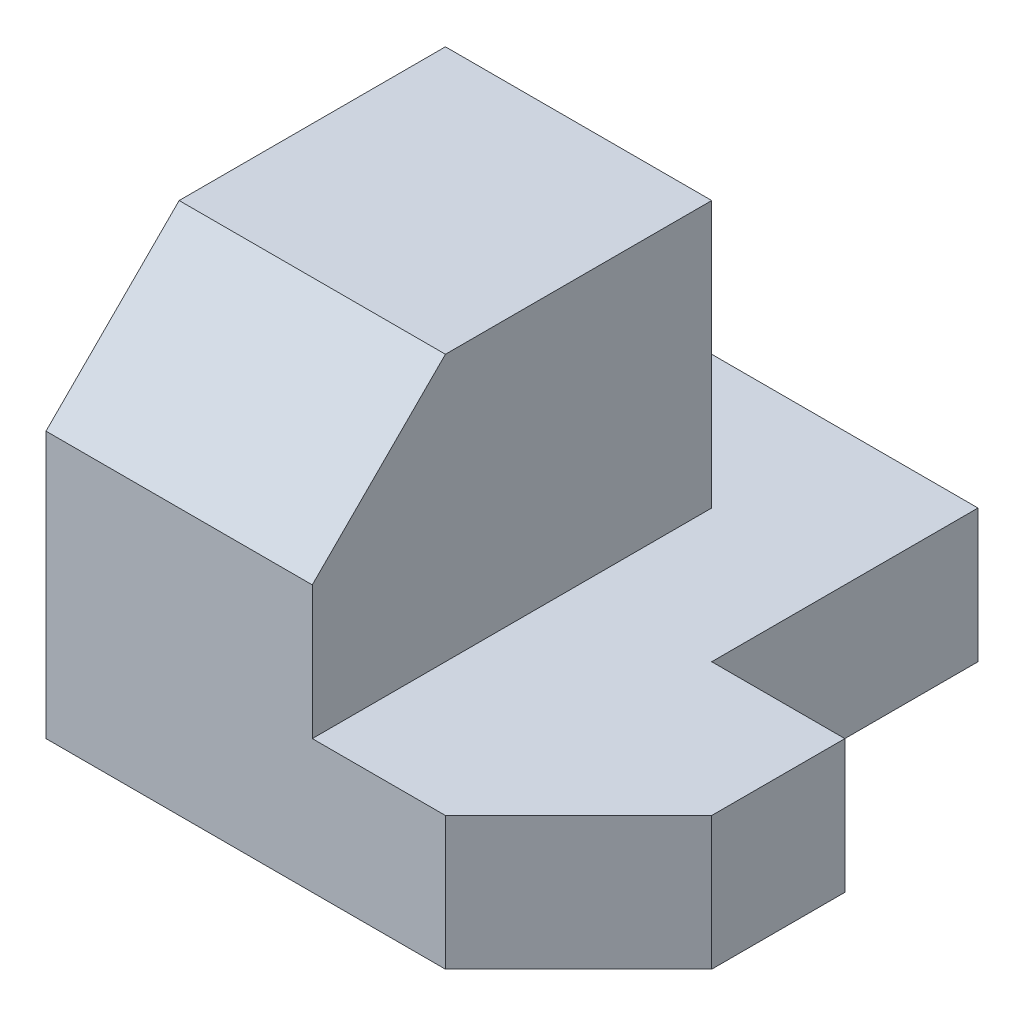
ISO-10303-21;
HEADER;
FILE_DESCRIPTION(('STEP AP214'),'2;1');
FILE_NAME('part.step','',(''),(''),'','','');
FILE_SCHEMA(('AUTOMOTIVE_DESIGN { 1 0 10303 214 1 1 1 1 }'));
ENDSEC;
DATA;
#1=APPLICATION_CONTEXT('core data for automotive mechanical design processes');
#2=APPLICATION_PROTOCOL_DEFINITION('international standard','automotive_design',2000,#1);
#3=PRODUCT_CONTEXT('',#1,'mechanical');
#4=PRODUCT('Part','Part','',(#3));
#5=PRODUCT_RELATED_PRODUCT_CATEGORY('part','',(#4));
#6=PRODUCT_DEFINITION_FORMATION('','',#4);
#7=PRODUCT_DEFINITION_CONTEXT('part definition',#1,'design');
#8=PRODUCT_DEFINITION('design','',#6,#7);
#9=PRODUCT_DEFINITION_SHAPE('','',#8);
#10=(LENGTH_UNIT() NAMED_UNIT(*) SI_UNIT(.MILLI.,.METRE.));
#11=(NAMED_UNIT(*) PLANE_ANGLE_UNIT() SI_UNIT($,.RADIAN.));
#12=(NAMED_UNIT(*) SI_UNIT($,.STERADIAN.) SOLID_ANGLE_UNIT());
#13=UNCERTAINTY_MEASURE_WITH_UNIT(LENGTH_MEASURE(1.E-05),#10,'distance_accuracy_value','');
#14=(GEOMETRIC_REPRESENTATION_CONTEXT(3) GLOBAL_UNCERTAINTY_ASSIGNED_CONTEXT((#13)) GLOBAL_UNIT_ASSIGNED_CONTEXT((#10,
#11,#12)) REPRESENTATION_CONTEXT('',''));
#15=CARTESIAN_POINT('',(0.,0.,0.));
#16=DIRECTION('',(0.,0.,1.));
#17=DIRECTION('',(1.,0.,0.));
#18=AXIS2_PLACEMENT_3D('',#15,#16,#17);
#19=CARTESIAN_POINT('',(30.,10.,0.));
#20=DIRECTION('',(0.,0.,1.));
#21=DIRECTION('',(1.,0.,0.));
#22=AXIS2_PLACEMENT_3D('',#19,#20,#21);
#23=PLANE('',#22);
#24=DIRECTION('',(-1.,0.,0.));
#25=VECTOR('',#24,1.);
#26=CARTESIAN_POINT('',(30.,0.,0.));
#27=LINE('',#26,#25);
#28=CARTESIAN_POINT('',(30.,0.,0.));
#29=VERTEX_POINT('',#28);
#30=CARTESIAN_POINT('',(0.,0.,0.));
#31=VERTEX_POINT('',#30);
#32=EDGE_CURVE('E152',#29,#31,#27,.T.);
#33=ORIENTED_EDGE('',*,*,#32,.T.);
#34=DIRECTION('',(0.,-1.,0.));
#35=VECTOR('',#34,1.);
#36=CARTESIAN_POINT('',(0.,10.,0.));
#37=LINE('',#36,#35);
#38=CARTESIAN_POINT('',(0.,10.,0.));
#39=VERTEX_POINT('',#38);
#40=EDGE_CURVE('E150',#39,#31,#37,.T.);
#41=ORIENTED_EDGE('',*,*,#40,.F.);
#42=DIRECTION('',(-1.,0.,0.));
#43=VECTOR('',#42,1.);
#44=CARTESIAN_POINT('',(30.,10.,0.));
#45=LINE('',#44,#43);
#46=CARTESIAN_POINT('',(30.,10.,0.));
#47=VERTEX_POINT('',#46);
#48=EDGE_CURVE('E176',#47,#39,#45,.T.);
#49=ORIENTED_EDGE('',*,*,#48,.F.);
#50=DIRECTION('',(0.,-1.,0.));
#51=VECTOR('',#50,1.);
#52=CARTESIAN_POINT('',(30.,10.,0.));
#53=LINE('',#52,#51);
#54=EDGE_CURVE('E177',#47,#29,#53,.T.);
#55=ORIENTED_EDGE('',*,*,#54,.T.);
#56=EDGE_LOOP('',(#33,#41,#49,#55));
#57=FACE_BOUND('',#56,.T.);
#58=ADVANCED_FACE('F30',(#57),#23,.F.);
#59=CARTESIAN_POINT('',(0.,10.,0.));
#60=DIRECTION('',(1.,0.,0.));
#61=DIRECTION('',(0.,0.,-1.));
#62=AXIS2_PLACEMENT_3D('',#59,#60,#61);
#63=PLANE('',#62);
#64=DIRECTION('',(0.,-1.,0.));
#65=VECTOR('',#64,1.);
#66=CARTESIAN_POINT('',(0.,10.,40.));
#67=LINE('',#66,#65);
#68=CARTESIAN_POINT('',(0.,20.,40.));
#69=VERTEX_POINT('',#68);
#70=CARTESIAN_POINT('',(0.,0.,40.));
#71=VERTEX_POINT('',#70);
#72=EDGE_CURVE('E191',#69,#71,#67,.T.);
#73=ORIENTED_EDGE('',*,*,#72,.F.);
#74=DIRECTION('',(0.,-0.707106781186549,0.707106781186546));
#75=VECTOR('',#74,1.);
#76=CARTESIAN_POINT('',(0.,30.,30.));
#77=LINE('',#76,#75);
#78=CARTESIAN_POINT('',(0.,30.,30.));
#79=VERTEX_POINT('',#78);
#80=EDGE_CURVE('E11',#69,#79,#77,.F.);
#81=ORIENTED_EDGE('',*,*,#80,.T.);
#82=DIRECTION('',(0.,0.,1.));
#83=VECTOR('',#82,1.);
#84=CARTESIAN_POINT('',(0.,30.,40.));
#85=LINE('',#84,#83);
#86=CARTESIAN_POINT('',(0.,30.,10.));
#87=VERTEX_POINT('',#86);
#88=EDGE_CURVE('E119',#87,#79,#85,.T.);
#89=ORIENTED_EDGE('',*,*,#88,.F.);
#90=DIRECTION('',(0.,-1.,0.));
#91=VECTOR('',#90,1.);
#92=CARTESIAN_POINT('',(0.,30.,10.));
#93=LINE('',#92,#91);
#94=CARTESIAN_POINT('',(0.,10.,10.));
#95=VERTEX_POINT('',#94);
#96=EDGE_CURVE('E130',#87,#95,#93,.T.);
#97=ORIENTED_EDGE('',*,*,#96,.T.);
#98=DIRECTION('',(0.,0.,1.));
#99=VECTOR('',#98,1.);
#100=CARTESIAN_POINT('',(0.,10.,0.));
#101=LINE('',#100,#99);
#102=EDGE_CURVE('E195',#39,#95,#101,.T.);
#103=ORIENTED_EDGE('',*,*,#102,.F.);
#104=ORIENTED_EDGE('',*,*,#40,.T.);
#105=DIRECTION('',(0.,0.,1.));
#106=VECTOR('',#105,1.);
#107=CARTESIAN_POINT('',(0.,0.,0.));
#108=LINE('',#107,#106);
#109=EDGE_CURVE('E154',#31,#71,#108,.T.);
#110=ORIENTED_EDGE('',*,*,#109,.T.);
#111=EDGE_LOOP('',(#73,#81,#89,#97,#103,#104,#110));
#112=FACE_BOUND('',#111,.T.);
#113=ADVANCED_FACE('F220',(#112),#63,.F.);
#114=CARTESIAN_POINT('',(0.,10.,40.));
#115=DIRECTION('',(0.,0.,-1.));
#116=DIRECTION('',(-1.,0.,0.));
#117=AXIS2_PLACEMENT_3D('',#114,#115,#116);
#118=PLANE('',#117);
#119=DIRECTION('',(0.,-1.,0.));
#120=VECTOR('',#119,1.);
#121=CARTESIAN_POINT('',(20.,30.,40.));
#122=LINE('',#121,#120);
#123=CARTESIAN_POINT('',(20.,20.,40.));
#124=VERTEX_POINT('',#123);
#125=CARTESIAN_POINT('',(20.,10.,40.));
#126=VERTEX_POINT('',#125);
#127=EDGE_CURVE('E129',#124,#126,#122,.T.);
#128=ORIENTED_EDGE('',*,*,#127,.F.);
#129=DIRECTION('',(-1.,0.,0.));
#130=VECTOR('',#129,1.);
#131=CARTESIAN_POINT('',(0.,20.,40.));
#132=LINE('',#131,#130);
#133=EDGE_CURVE('E38',#124,#69,#132,.T.);
#134=ORIENTED_EDGE('',*,*,#133,.T.);
#135=ORIENTED_EDGE('',*,*,#72,.T.);
#136=DIRECTION('',(1.,0.,0.));
#137=VECTOR('',#136,1.);
#138=CARTESIAN_POINT('',(0.,0.,40.));
#139=LINE('',#138,#137);
#140=CARTESIAN_POINT('',(30.,0.,40.));
#141=VERTEX_POINT('',#140);
#142=EDGE_CURVE('E161',#71,#141,#139,.T.);
#143=ORIENTED_EDGE('',*,*,#142,.T.);
#144=DIRECTION('',(0.,-1.,0.));
#145=VECTOR('',#144,1.);
#146=CARTESIAN_POINT('',(30.,10.,40.));
#147=LINE('',#146,#145);
#148=CARTESIAN_POINT('',(30.,10.,40.));
#149=VERTEX_POINT('',#148);
#150=EDGE_CURVE('E188',#149,#141,#147,.T.);
#151=ORIENTED_EDGE('',*,*,#150,.F.);
#152=DIRECTION('',(1.,0.,0.));
#153=VECTOR('',#152,1.);
#154=CARTESIAN_POINT('',(0.,10.,40.));
#155=LINE('',#154,#153);
#156=EDGE_CURVE('E198',#126,#149,#155,.T.);
#157=ORIENTED_EDGE('',*,*,#156,.F.);
#158=EDGE_LOOP('',(#128,#134,#135,#143,#151,#157));
#159=FACE_BOUND('',#158,.T.);
#160=ADVANCED_FACE('F224',(#159),#118,.F.);
#161=CARTESIAN_POINT('',(30.,10.,40.));
#162=DIRECTION('',(-0.707106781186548,0.,-0.707106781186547));
#163=DIRECTION('',(-0.707106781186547,0.,0.707106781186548));
#164=AXIS2_PLACEMENT_3D('',#161,#162,#163);
#165=PLANE('',#164);
#166=DIRECTION('',(0.707106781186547,0.,-0.707106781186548));
#167=VECTOR('',#166,1.);
#168=CARTESIAN_POINT('',(30.,0.,40.));
#169=LINE('',#168,#167);
#170=CARTESIAN_POINT('',(40.,0.,30.));
#171=VERTEX_POINT('',#170);
#172=EDGE_CURVE('E168',#141,#171,#169,.T.);
#173=ORIENTED_EDGE('',*,*,#172,.T.);
#174=DIRECTION('',(0.,-1.,0.));
#175=VECTOR('',#174,1.);
#176=CARTESIAN_POINT('',(40.,10.,30.));
#177=LINE('',#176,#175);
#178=CARTESIAN_POINT('',(40.,10.,30.));
#179=VERTEX_POINT('',#178);
#180=EDGE_CURVE('E185',#179,#171,#177,.T.);
#181=ORIENTED_EDGE('',*,*,#180,.F.);
#182=DIRECTION('',(0.707106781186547,0.,-0.707106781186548));
#183=VECTOR('',#182,1.);
#184=CARTESIAN_POINT('',(30.,10.,40.));
#185=LINE('',#184,#183);
#186=EDGE_CURVE('E204',#149,#179,#185,.T.);
#187=ORIENTED_EDGE('',*,*,#186,.F.);
#188=ORIENTED_EDGE('',*,*,#150,.T.);
#189=EDGE_LOOP('',(#173,#181,#187,#188));
#190=FACE_BOUND('',#189,.T.);
#191=ADVANCED_FACE('F229',(#190),#165,.F.);
#192=CARTESIAN_POINT('',(40.,10.,30.));
#193=DIRECTION('',(-1.,0.,0.));
#194=DIRECTION('',(0.,0.,1.));
#195=AXIS2_PLACEMENT_3D('',#192,#193,#194);
#196=PLANE('',#195);
#197=DIRECTION('',(0.,0.,-1.));
#198=VECTOR('',#197,1.);
#199=CARTESIAN_POINT('',(40.,0.,30.));
#200=LINE('',#199,#198);
#201=CARTESIAN_POINT('',(40.,0.,20.));
#202=VERTEX_POINT('',#201);
#203=EDGE_CURVE('E170',#171,#202,#200,.T.);
#204=ORIENTED_EDGE('',*,*,#203,.T.);
#205=DIRECTION('',(0.,-1.,0.));
#206=VECTOR('',#205,1.);
#207=CARTESIAN_POINT('',(40.,10.,20.));
#208=LINE('',#207,#206);
#209=CARTESIAN_POINT('',(40.,10.,20.));
#210=VERTEX_POINT('',#209);
#211=EDGE_CURVE('E182',#210,#202,#208,.T.);
#212=ORIENTED_EDGE('',*,*,#211,.F.);
#213=DIRECTION('',(0.,0.,-1.));
#214=VECTOR('',#213,1.);
#215=CARTESIAN_POINT('',(40.,10.,30.));
#216=LINE('',#215,#214);
#217=EDGE_CURVE('E206',#179,#210,#216,.T.);
#218=ORIENTED_EDGE('',*,*,#217,.F.);
#219=ORIENTED_EDGE('',*,*,#180,.T.);
#220=EDGE_LOOP('',(#204,#212,#218,#219));
#221=FACE_BOUND('',#220,.T.);
#222=ADVANCED_FACE('F233',(#221),#196,.F.);
#223=CARTESIAN_POINT('',(40.,10.,20.));
#224=DIRECTION('',(0.,0.,1.));
#225=DIRECTION('',(1.,0.,0.));
#226=AXIS2_PLACEMENT_3D('',#223,#224,#225);
#227=PLANE('',#226);
#228=DIRECTION('',(-1.,0.,0.));
#229=VECTOR('',#228,1.);
#230=CARTESIAN_POINT('',(40.,0.,20.));
#231=LINE('',#230,#229);
#232=CARTESIAN_POINT('',(30.,0.,20.));
#233=VERTEX_POINT('',#232);
#234=EDGE_CURVE('E172',#202,#233,#231,.T.);
#235=ORIENTED_EDGE('',*,*,#234,.T.);
#236=DIRECTION('',(0.,-1.,0.));
#237=VECTOR('',#236,1.);
#238=CARTESIAN_POINT('',(30.,10.,20.));
#239=LINE('',#238,#237);
#240=CARTESIAN_POINT('',(30.,10.,20.));
#241=VERTEX_POINT('',#240);
#242=EDGE_CURVE('E179',#241,#233,#239,.T.);
#243=ORIENTED_EDGE('',*,*,#242,.F.);
#244=DIRECTION('',(-1.,0.,0.));
#245=VECTOR('',#244,1.);
#246=CARTESIAN_POINT('',(40.,10.,20.));
#247=LINE('',#246,#245);
#248=EDGE_CURVE('E207',#210,#241,#247,.T.);
#249=ORIENTED_EDGE('',*,*,#248,.F.);
#250=ORIENTED_EDGE('',*,*,#211,.T.);
#251=EDGE_LOOP('',(#235,#243,#249,#250));
#252=FACE_BOUND('',#251,.T.);
#253=ADVANCED_FACE('F237',(#252),#227,.F.);
#254=CARTESIAN_POINT('',(30.,10.,20.));
#255=DIRECTION('',(-1.,0.,0.));
#256=DIRECTION('',(0.,0.,1.));
#257=AXIS2_PLACEMENT_3D('',#254,#255,#256);
#258=PLANE('',#257);
#259=DIRECTION('',(0.,0.,-1.));
#260=VECTOR('',#259,1.);
#261=CARTESIAN_POINT('',(30.,0.,20.));
#262=LINE('',#261,#260);
#263=EDGE_CURVE('E174',#233,#29,#262,.T.);
#264=ORIENTED_EDGE('',*,*,#263,.T.);
#265=ORIENTED_EDGE('',*,*,#54,.F.);
#266=DIRECTION('',(0.,0.,-1.));
#267=VECTOR('',#266,1.);
#268=CARTESIAN_POINT('',(30.,10.,20.));
#269=LINE('',#268,#267);
#270=EDGE_CURVE('E164',#241,#47,#269,.T.);
#271=ORIENTED_EDGE('',*,*,#270,.F.);
#272=ORIENTED_EDGE('',*,*,#242,.T.);
#273=EDGE_LOOP('',(#264,#265,#271,#272));
#274=FACE_BOUND('',#273,.T.);
#275=ADVANCED_FACE('F217',(#274),#258,.F.);
#276=CARTESIAN_POINT('',(0.,10.,0.));
#277=DIRECTION('',(0.,1.,0.));
#278=DIRECTION('',(0.,0.,1.));
#279=AXIS2_PLACEMENT_3D('',#276,#277,#278);
#280=PLANE('',#279);
#281=DIRECTION('',(-1.,0.,0.));
#282=VECTOR('',#281,1.);
#283=CARTESIAN_POINT('',(0.,10.,10.));
#284=LINE('',#283,#282);
#285=CARTESIAN_POINT('',(20.,10.,10.));
#286=VERTEX_POINT('',#285);
#287=EDGE_CURVE('E142',#286,#95,#284,.T.);
#288=ORIENTED_EDGE('',*,*,#287,.F.);
#289=DIRECTION('',(0.,0.,-1.));
#290=VECTOR('',#289,1.);
#291=CARTESIAN_POINT('',(20.,10.,40.));
#292=LINE('',#291,#290);
#293=EDGE_CURVE('E126',#126,#286,#292,.T.);
#294=ORIENTED_EDGE('',*,*,#293,.F.);
#295=ORIENTED_EDGE('',*,*,#156,.T.);
#296=ORIENTED_EDGE('',*,*,#186,.T.);
#297=ORIENTED_EDGE('',*,*,#217,.T.);
#298=ORIENTED_EDGE('',*,*,#248,.T.);
#299=ORIENTED_EDGE('',*,*,#270,.T.);
#300=ORIENTED_EDGE('',*,*,#48,.T.);
#301=ORIENTED_EDGE('',*,*,#102,.T.);
#302=EDGE_LOOP('',(#288,#294,#295,#296,#297,#298,#299,#300,#301));
#303=FACE_BOUND('',#302,.T.);
#304=ADVANCED_FACE('F214',(#303),#280,.T.);
#305=CARTESIAN_POINT('',(0.,0.,0.));
#306=DIRECTION('',(0.,1.,0.));
#307=DIRECTION('',(0.,0.,1.));
#308=AXIS2_PLACEMENT_3D('',#305,#306,#307);
#309=PLANE('',#308);
#310=ORIENTED_EDGE('',*,*,#32,.F.);
#311=ORIENTED_EDGE('',*,*,#263,.F.);
#312=ORIENTED_EDGE('',*,*,#234,.F.);
#313=ORIENTED_EDGE('',*,*,#203,.F.);
#314=ORIENTED_EDGE('',*,*,#172,.F.);
#315=ORIENTED_EDGE('',*,*,#142,.F.);
#316=ORIENTED_EDGE('',*,*,#109,.F.);
#317=EDGE_LOOP('',(#310,#311,#312,#313,#314,#315,#316));
#318=FACE_BOUND('',#317,.T.);
#319=ADVANCED_FACE('F239',(#318),#309,.F.);
#320=CARTESIAN_POINT('',(20.,30.,40.));
#321=DIRECTION('',(-1.,0.,0.));
#322=DIRECTION('',(0.,0.,1.));
#323=AXIS2_PLACEMENT_3D('',#320,#321,#322);
#324=PLANE('',#323);
#325=DIRECTION('',(0.,0.,-1.));
#326=VECTOR('',#325,1.);
#327=CARTESIAN_POINT('',(20.,30.,40.));
#328=LINE('',#327,#326);
#329=CARTESIAN_POINT('',(20.,30.,30.));
#330=VERTEX_POINT('',#329);
#331=CARTESIAN_POINT('',(20.,30.,10.));
#332=VERTEX_POINT('',#331);
#333=EDGE_CURVE('E110',#330,#332,#328,.T.);
#334=ORIENTED_EDGE('',*,*,#333,.F.);
#335=DIRECTION('',(0.,0.707106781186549,-0.707106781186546));
#336=VECTOR('',#335,1.);
#337=CARTESIAN_POINT('',(20.,30.,30.));
#338=LINE('',#337,#336);
#339=EDGE_CURVE('E52',#330,#124,#338,.F.);
#340=ORIENTED_EDGE('',*,*,#339,.T.);
#341=ORIENTED_EDGE('',*,*,#127,.T.);
#342=ORIENTED_EDGE('',*,*,#293,.T.);
#343=DIRECTION('',(0.,-1.,0.));
#344=VECTOR('',#343,1.);
#345=CARTESIAN_POINT('',(20.,30.,10.));
#346=LINE('',#345,#344);
#347=EDGE_CURVE('E123',#332,#286,#346,.T.);
#348=ORIENTED_EDGE('',*,*,#347,.F.);
#349=EDGE_LOOP('',(#334,#340,#341,#342,#348));
#350=FACE_BOUND('',#349,.T.);
#351=ADVANCED_FACE('F124',(#350),#324,.F.);
#352=CARTESIAN_POINT('',(0.,30.,10.));
#353=DIRECTION('',(0.,0.,1.));
#354=DIRECTION('',(1.,0.,0.));
#355=AXIS2_PLACEMENT_3D('',#352,#353,#354);
#356=PLANE('',#355);
#357=ORIENTED_EDGE('',*,*,#287,.T.);
#358=ORIENTED_EDGE('',*,*,#96,.F.);
#359=DIRECTION('',(-1.,0.,0.));
#360=VECTOR('',#359,1.);
#361=CARTESIAN_POINT('',(0.,30.,10.));
#362=LINE('',#361,#360);
#363=EDGE_CURVE('E115',#332,#87,#362,.T.);
#364=ORIENTED_EDGE('',*,*,#363,.F.);
#365=ORIENTED_EDGE('',*,*,#347,.T.);
#366=EDGE_LOOP('',(#357,#358,#364,#365));
#367=FACE_BOUND('',#366,.T.);
#368=ADVANCED_FACE('F132',(#367),#356,.F.);
#369=CARTESIAN_POINT('',(0.,30.,10.));
#370=DIRECTION('',(0.,-1.,0.));
#371=DIRECTION('',(0.,0.,-1.));
#372=AXIS2_PLACEMENT_3D('',#369,#370,#371);
#373=PLANE('',#372);
#374=ORIENTED_EDGE('',*,*,#88,.T.);
#375=DIRECTION('',(1.,0.,0.));
#376=VECTOR('',#375,1.);
#377=CARTESIAN_POINT('',(0.,30.,30.));
#378=LINE('',#377,#376);
#379=EDGE_CURVE('E118',#79,#330,#378,.T.);
#380=ORIENTED_EDGE('',*,*,#379,.T.);
#381=ORIENTED_EDGE('',*,*,#333,.T.);
#382=ORIENTED_EDGE('',*,*,#363,.T.);
#383=EDGE_LOOP('',(#374,#380,#381,#382));
#384=FACE_BOUND('',#383,.T.);
#385=ADVANCED_FACE('F113',(#384),#373,.F.);
#386=CARTESIAN_POINT('',(0.,30.,30.));
#387=DIRECTION('',(0.,-0.707106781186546,-0.707106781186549));
#388=DIRECTION('',(0.,0.707106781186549,-0.707106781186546));
#389=AXIS2_PLACEMENT_3D('',#386,#387,#388);
#390=PLANE('',#389);
#391=ORIENTED_EDGE('',*,*,#80,.F.);
#392=ORIENTED_EDGE('',*,*,#133,.F.);
#393=ORIENTED_EDGE('',*,*,#339,.F.);
#394=ORIENTED_EDGE('',*,*,#379,.F.);
#395=EDGE_LOOP('',(#391,#392,#393,#394));
#396=FACE_BOUND('',#395,.T.);
#397=ADVANCED_FACE('F32',(#396),#390,.F.);
#398=CLOSED_SHELL('',(#58,#113,#160,#191,#222,#253,#275,#304,#319,#351,#368,#385,#397));
#399=MANIFOLD_SOLID_BREP('B2',#398);
#400=ADVANCED_BREP_SHAPE_REPRESENTATION('',(#18,#399),#14);
#401=SHAPE_DEFINITION_REPRESENTATION(#9,#400);
ENDSEC;
END-ISO-10303-21;
